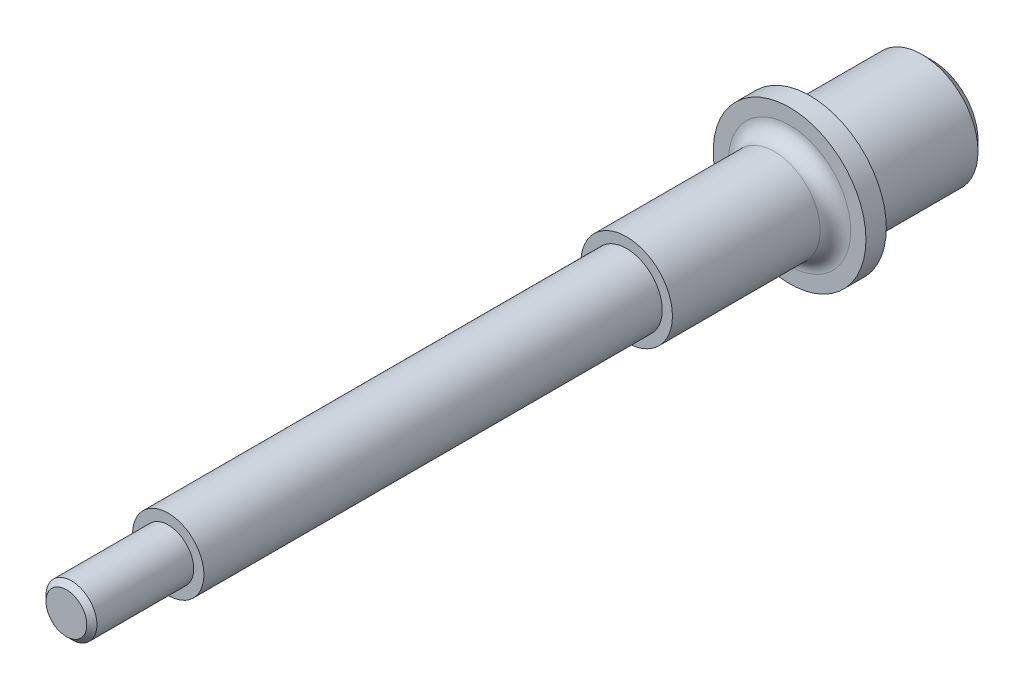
ISO-10303-21;
HEADER;
FILE_DESCRIPTION(('STEP AP214'),'2;1');
FILE_NAME('part.step','',(''),(''),'','','');
FILE_SCHEMA(('AUTOMOTIVE_DESIGN { 1 0 10303 214 1 1 1 1 }'));
ENDSEC;
DATA;
#1=APPLICATION_CONTEXT('core data for automotive mechanical design processes');
#2=APPLICATION_PROTOCOL_DEFINITION('international standard','automotive_design',2000,#1);
#3=PRODUCT_CONTEXT('',#1,'mechanical');
#4=PRODUCT('Part','Part','',(#3));
#5=PRODUCT_RELATED_PRODUCT_CATEGORY('part','',(#4));
#6=PRODUCT_DEFINITION_FORMATION('','',#4);
#7=PRODUCT_DEFINITION_CONTEXT('part definition',#1,'design');
#8=PRODUCT_DEFINITION('design','',#6,#7);
#9=PRODUCT_DEFINITION_SHAPE('','',#8);
#10=(LENGTH_UNIT() NAMED_UNIT(*) SI_UNIT(.MILLI.,.METRE.));
#11=(NAMED_UNIT(*) PLANE_ANGLE_UNIT() SI_UNIT($,.RADIAN.));
#12=(NAMED_UNIT(*) SI_UNIT($,.STERADIAN.) SOLID_ANGLE_UNIT());
#13=UNCERTAINTY_MEASURE_WITH_UNIT(LENGTH_MEASURE(1.E-05),#10,'distance_accuracy_value','');
#14=(GEOMETRIC_REPRESENTATION_CONTEXT(3) GLOBAL_UNCERTAINTY_ASSIGNED_CONTEXT((#13)) GLOBAL_UNIT_ASSIGNED_CONTEXT((#10,
#11,#12)) REPRESENTATION_CONTEXT('',''));
#15=CARTESIAN_POINT('',(0.,0.,0.));
#16=DIRECTION('',(0.,0.,1.));
#17=DIRECTION('',(1.,0.,0.));
#18=AXIS2_PLACEMENT_3D('',#15,#16,#17);
#19=CARTESIAN_POINT('',(0.,0.,24.));
#20=DIRECTION('',(0.,0.,-1.));
#21=DIRECTION('',(-1.,0.,0.));
#22=AXIS2_PLACEMENT_3D('',#19,#20,#21);
#23=CYLINDRICAL_SURFACE('',#22,11.);
#24=CARTESIAN_POINT('',(0.,0.,2.00000000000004));
#25=DIRECTION('',(0.,0.,1.));
#26=DIRECTION('',(1.,0.,0.));
#27=AXIS2_PLACEMENT_3D('',#24,#25,#26);
#28=CIRCLE('',#27,11.);
#29=CARTESIAN_POINT('',(11.,0.,2.00000000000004));
#30=VERTEX_POINT('',#29);
#31=EDGE_CURVE('E73',#30,#30,#28,.T.);
#32=ORIENTED_EDGE('',*,*,#31,.T.);
#33=EDGE_LOOP('',(#32));
#34=FACE_BOUND('',#33,.T.);
#35=CARTESIAN_POINT('',(0.,0.,24.));
#36=DIRECTION('',(0.,0.,1.));
#37=DIRECTION('',(1.,0.,0.));
#38=AXIS2_PLACEMENT_3D('',#35,#36,#37);
#39=CIRCLE('',#38,11.);
#40=CARTESIAN_POINT('',(11.,0.,24.));
#41=VERTEX_POINT('',#40);
#42=EDGE_CURVE('E78',#41,#41,#39,.T.);
#43=ORIENTED_EDGE('',*,*,#42,.F.);
#44=EDGE_LOOP('',(#43));
#45=FACE_BOUND('',#44,.T.);
#46=ADVANCED_FACE('F45',(#34,#45),#23,.T.);
#47=CARTESIAN_POINT('',(0.,0.,0.));
#48=DIRECTION('',(0.,0.,1.));
#49=DIRECTION('',(1.,0.,0.));
#50=AXIS2_PLACEMENT_3D('',#47,#48,#49);
#51=PLANE('',#50);
#52=CARTESIAN_POINT('',(0.,0.,0.));
#53=DIRECTION('',(0.,0.,1.));
#54=DIRECTION('',(1.,0.,0.));
#55=AXIS2_PLACEMENT_3D('',#52,#53,#54);
#56=CIRCLE('',#55,8.99999999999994);
#57=CARTESIAN_POINT('',(8.99999999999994,0.,0.));
#58=VERTEX_POINT('',#57);
#59=EDGE_CURVE('E69',#58,#58,#56,.F.);
#60=ORIENTED_EDGE('',*,*,#59,.T.);
#61=EDGE_LOOP('',(#60));
#62=FACE_BOUND('',#61,.T.);
#63=ADVANCED_FACE('F138',(#62),#51,.F.);
#64=CARTESIAN_POINT('',(0.,0.,28.));
#65=DIRECTION('',(0.,0.,-1.));
#66=DIRECTION('',(-1.,0.,0.));
#67=AXIS2_PLACEMENT_3D('',#64,#65,#66);
#68=CYLINDRICAL_SURFACE('',#67,15.);
#69=CARTESIAN_POINT('',(0.,0.,28.));
#70=DIRECTION('',(0.,0.,1.));
#71=DIRECTION('',(1.,0.,0.));
#72=AXIS2_PLACEMENT_3D('',#69,#70,#71);
#73=CIRCLE('',#72,15.);
#74=CARTESIAN_POINT('',(15.,0.,28.));
#75=VERTEX_POINT('',#74);
#76=EDGE_CURVE('E83',#75,#75,#73,.T.);
#77=ORIENTED_EDGE('',*,*,#76,.F.);
#78=EDGE_LOOP('',(#77));
#79=FACE_BOUND('',#78,.T.);
#80=CARTESIAN_POINT('',(0.,0.,24.));
#81=DIRECTION('',(0.,0.,1.));
#82=DIRECTION('',(1.,0.,0.));
#83=AXIS2_PLACEMENT_3D('',#80,#81,#82);
#84=CIRCLE('',#83,15.);
#85=CARTESIAN_POINT('',(15.,0.,24.));
#86=VERTEX_POINT('',#85);
#87=EDGE_CURVE('E84',#86,#86,#84,.T.);
#88=ORIENTED_EDGE('',*,*,#87,.T.);
#89=EDGE_LOOP('',(#88));
#90=FACE_BOUND('',#89,.T.);
#91=ADVANCED_FACE('F145',(#79,#90),#68,.T.);
#92=CARTESIAN_POINT('',(0.,0.,28.));
#93=DIRECTION('',(0.,0.,1.));
#94=DIRECTION('',(1.,0.,0.));
#95=AXIS2_PLACEMENT_3D('',#92,#93,#94);
#96=PLANE('',#95);
#97=CARTESIAN_POINT('',(0.,0.,28.));
#98=DIRECTION('',(0.,0.,1.));
#99=DIRECTION('',(1.,0.,0.));
#100=AXIS2_PLACEMENT_3D('',#97,#98,#99);
#101=CIRCLE('',#100,12.);
#102=CARTESIAN_POINT('',(12.,0.,28.));
#103=VERTEX_POINT('',#102);
#104=EDGE_CURVE('E10',#103,#103,#101,.F.);
#105=ORIENTED_EDGE('',*,*,#104,.T.);
#106=EDGE_LOOP('',(#105));
#107=FACE_BOUND('',#106,.T.);
#108=ORIENTED_EDGE('',*,*,#76,.T.);
#109=EDGE_LOOP('',(#108));
#110=FACE_BOUND('',#109,.T.);
#111=ADVANCED_FACE('F133',(#107,#110),#96,.T.);
#112=CARTESIAN_POINT('',(0.,0.,24.));
#113=DIRECTION('',(0.,0.,1.));
#114=DIRECTION('',(1.,0.,0.));
#115=AXIS2_PLACEMENT_3D('',#112,#113,#114);
#116=PLANE('',#115);
#117=ORIENTED_EDGE('',*,*,#42,.T.);
#118=EDGE_LOOP('',(#117));
#119=FACE_BOUND('',#118,.T.);
#120=ORIENTED_EDGE('',*,*,#87,.F.);
#121=EDGE_LOOP('',(#120));
#122=FACE_BOUND('',#121,.T.);
#123=ADVANCED_FACE('F128',(#119,#122),#116,.F.);
#124=CARTESIAN_POINT('',(0.,0.,60.));
#125=DIRECTION('',(0.,0.,-1.));
#126=DIRECTION('',(-1.,0.,0.));
#127=AXIS2_PLACEMENT_3D('',#124,#125,#126);
#128=CYLINDRICAL_SURFACE('',#127,9.);
#129=CARTESIAN_POINT('',(0.,0.,31.));
#130=DIRECTION('',(0.,0.,1.));
#131=DIRECTION('',(1.,0.,0.));
#132=AXIS2_PLACEMENT_3D('',#129,#130,#131);
#133=CIRCLE('',#132,9.);
#134=CARTESIAN_POINT('',(9.,0.,31.));
#135=VERTEX_POINT('',#134);
#136=EDGE_CURVE('E53',#135,#135,#133,.T.);
#137=ORIENTED_EDGE('',*,*,#136,.T.);
#138=EDGE_LOOP('',(#137));
#139=FACE_BOUND('',#138,.T.);
#140=CARTESIAN_POINT('',(0.,0.,60.));
#141=DIRECTION('',(0.,0.,1.));
#142=DIRECTION('',(1.,0.,0.));
#143=AXIS2_PLACEMENT_3D('',#140,#141,#142);
#144=CIRCLE('',#143,9.);
#145=CARTESIAN_POINT('',(9.,0.,60.));
#146=VERTEX_POINT('',#145);
#147=EDGE_CURVE('E88',#146,#146,#144,.T.);
#148=ORIENTED_EDGE('',*,*,#147,.F.);
#149=EDGE_LOOP('',(#148));
#150=FACE_BOUND('',#149,.T.);
#151=ADVANCED_FACE('F123',(#139,#150),#128,.T.);
#152=CARTESIAN_POINT('',(0.,0.,60.));
#153=DIRECTION('',(0.,0.,1.));
#154=DIRECTION('',(1.,0.,0.));
#155=AXIS2_PLACEMENT_3D('',#152,#153,#154);
#156=PLANE('',#155);
#157=CARTESIAN_POINT('',(0.,0.,60.));
#158=DIRECTION('',(0.,0.,1.));
#159=DIRECTION('',(1.,0.,0.));
#160=AXIS2_PLACEMENT_3D('',#157,#158,#159);
#161=CIRCLE('',#160,7.);
#162=CARTESIAN_POINT('',(-7.,0.,60.));
#163=VERTEX_POINT('',#162);
#164=EDGE_CURVE('E82',#163,#163,#161,.T.);
#165=ORIENTED_EDGE('',*,*,#164,.F.);
#166=EDGE_LOOP('',(#165));
#167=FACE_BOUND('',#166,.T.);
#168=ORIENTED_EDGE('',*,*,#147,.T.);
#169=EDGE_LOOP('',(#168));
#170=FACE_BOUND('',#169,.T.);
#171=ADVANCED_FACE('F117',(#167,#170),#156,.T.);
#172=CARTESIAN_POINT('',(0.,0.,150.));
#173=DIRECTION('',(0.,0.,-1.));
#174=DIRECTION('',(-1.,0.,0.));
#175=AXIS2_PLACEMENT_3D('',#172,#173,#174);
#176=CYLINDRICAL_SURFACE('',#175,7.);
#177=CARTESIAN_POINT('',(0.,0.,150.));
#178=DIRECTION('',(0.,0.,1.));
#179=DIRECTION('',(1.,0.,0.));
#180=AXIS2_PLACEMENT_3D('',#177,#178,#179);
#181=CIRCLE('',#180,7.);
#182=CARTESIAN_POINT('',(-7.,0.,150.));
#183=VERTEX_POINT('',#182);
#184=EDGE_CURVE('E95',#183,#183,#181,.T.);
#185=CARTESIAN_POINT('',(-7.,0.,150.));
#186=CARTESIAN_POINT('',(-7.,0.,149.0625));
#187=CARTESIAN_POINT('',(-7.,0.,148.125));
#188=CARTESIAN_POINT('',(-7.,0.,146.25));
#189=CARTESIAN_POINT('',(-7.,0.,145.3125));
#190=CARTESIAN_POINT('',(-7.,0.,143.4375));
#191=CARTESIAN_POINT('',(-7.,0.,142.5));
#192=CARTESIAN_POINT('',(-7.,0.,140.625));
#193=CARTESIAN_POINT('',(-7.,0.,139.6875));
#194=CARTESIAN_POINT('',(-7.,0.,137.8125));
#195=CARTESIAN_POINT('',(-7.,0.,136.875));
#196=CARTESIAN_POINT('',(-7.,0.,135.));
#197=CARTESIAN_POINT('',(-7.,0.,134.0625));
#198=CARTESIAN_POINT('',(-7.,0.,132.1875));
#199=CARTESIAN_POINT('',(-7.,0.,131.25));
#200=CARTESIAN_POINT('',(-7.,0.,129.375));
#201=CARTESIAN_POINT('',(-7.,0.,128.4375));
#202=CARTESIAN_POINT('',(-7.,0.,126.5625));
#203=CARTESIAN_POINT('',(-7.,0.,125.625));
#204=CARTESIAN_POINT('',(-7.,0.,123.75));
#205=CARTESIAN_POINT('',(-7.,0.,122.8125));
#206=CARTESIAN_POINT('',(-7.,0.,120.9375));
#207=CARTESIAN_POINT('',(-7.,0.,120.));
#208=CARTESIAN_POINT('',(-7.,0.,118.125));
#209=CARTESIAN_POINT('',(-7.,0.,117.1875));
#210=CARTESIAN_POINT('',(-7.,0.,115.3125));
#211=CARTESIAN_POINT('',(-7.,0.,114.375));
#212=CARTESIAN_POINT('',(-7.,0.,112.5));
#213=CARTESIAN_POINT('',(-7.,0.,111.5625));
#214=CARTESIAN_POINT('',(-7.,0.,109.6875));
#215=CARTESIAN_POINT('',(-7.,0.,108.75));
#216=CARTESIAN_POINT('',(-7.,0.,106.875));
#217=CARTESIAN_POINT('',(-7.,0.,105.9375));
#218=CARTESIAN_POINT('',(-7.,0.,104.0625));
#219=CARTESIAN_POINT('',(-7.,0.,103.125));
#220=CARTESIAN_POINT('',(-7.,0.,101.25));
#221=CARTESIAN_POINT('',(-7.,0.,100.3125));
#222=CARTESIAN_POINT('',(-7.,0.,98.4375));
#223=CARTESIAN_POINT('',(-7.,0.,97.5));
#224=CARTESIAN_POINT('',(-7.,0.,95.625));
#225=CARTESIAN_POINT('',(-7.,0.,94.6875));
#226=CARTESIAN_POINT('',(-7.,0.,92.8125));
#227=CARTESIAN_POINT('',(-7.,0.,91.875));
#228=CARTESIAN_POINT('',(-7.,0.,90.));
#229=CARTESIAN_POINT('',(-7.,0.,89.0625));
#230=CARTESIAN_POINT('',(-7.,0.,87.1875));
#231=CARTESIAN_POINT('',(-7.,0.,86.25));
#232=CARTESIAN_POINT('',(-7.,0.,84.375));
#233=CARTESIAN_POINT('',(-7.,0.,83.4375));
#234=CARTESIAN_POINT('',(-7.,0.,81.5625));
#235=CARTESIAN_POINT('',(-7.,0.,80.625));
#236=CARTESIAN_POINT('',(-7.,0.,78.75));
#237=CARTESIAN_POINT('',(-7.,0.,77.8125));
#238=CARTESIAN_POINT('',(-7.,0.,75.9375));
#239=CARTESIAN_POINT('',(-7.,0.,75.));
#240=CARTESIAN_POINT('',(-7.,0.,73.125));
#241=CARTESIAN_POINT('',(-7.,0.,72.1875));
#242=CARTESIAN_POINT('',(-7.,0.,70.3125));
#243=CARTESIAN_POINT('',(-7.,0.,69.375));
#244=CARTESIAN_POINT('',(-7.,0.,67.5));
#245=CARTESIAN_POINT('',(-7.,0.,66.5625));
#246=CARTESIAN_POINT('',(-7.,0.,64.6875));
#247=CARTESIAN_POINT('',(-7.,0.,63.75));
#248=CARTESIAN_POINT('',(-7.,0.,61.875));
#249=CARTESIAN_POINT('',(-7.,0.,60.9375));
#250=CARTESIAN_POINT('',(-7.,0.,60.));
#251=B_SPLINE_CURVE_WITH_KNOTS('',3,(#185,#186,#187,#188,#189,#190,#191,#192,#193,#194,#195,
#196,#197,#198,#199,#200,#201,#202,#203,#204,#205,#206,#207,#208,#209,#210,#211,#212,#213,#214,
#215,#216,#217,#218,#219,#220,#221,#222,#223,#224,#225,#226,#227,#228,#229,#230,#231,#232,#233,
#234,#235,#236,#237,#238,#239,#240,#241,#242,#243,#244,#245,#246,#247,#248,#249,#250),
.UNSPECIFIED.,.F.,.F.,(4,2,2,2,2,2,2,2,2,2,2,2,2,2,2,2,2,2,2,2,2,2,2,2,2,2,2,2,2,2,2,2,4),(0.,
2.8125,5.62499999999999,8.43749999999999,11.25,14.0625,16.875,19.6875,22.5,25.3125,28.125,
30.9375,33.75,36.5625,39.375,42.1875,45.,47.8125,50.625,53.4375,56.25,59.0625,61.875,64.6875,
67.5,70.3125,73.125,75.9375,78.75,81.5625,84.375,87.1875,90.),.UNSPECIFIED.);
#252=EDGE_CURVE('BSEAM111',#183,#163,#251,.T.);
#253=ORIENTED_EDGE('',*,*,#184,.F.);
#254=ORIENTED_EDGE('',*,*,#164,.T.);
#255=ORIENTED_EDGE('',*,*,#252,.T.);
#256=ORIENTED_EDGE('',*,*,#252,.F.);
#257=EDGE_LOOP('',(#253,#255,#254,#256));
#258=FACE_BOUND('',#257,.T.);
#259=ADVANCED_FACE('F111',(#258),#176,.T.);
#260=CARTESIAN_POINT('',(0.,0.,150.));
#261=DIRECTION('',(0.,0.,1.));
#262=DIRECTION('',(1.,0.,0.));
#263=AXIS2_PLACEMENT_3D('',#260,#261,#262);
#264=PLANE('',#263);
#265=CARTESIAN_POINT('',(0.,0.,150.));
#266=DIRECTION('',(0.,0.,1.));
#267=DIRECTION('',(1.,0.,0.));
#268=AXIS2_PLACEMENT_3D('',#265,#266,#267);
#269=CIRCLE('',#268,5.);
#270=CARTESIAN_POINT('',(5.,0.,150.));
#271=VERTEX_POINT('',#270);
#272=EDGE_CURVE('E77',#271,#271,#269,.T.);
#273=ORIENTED_EDGE('',*,*,#272,.F.);
#274=EDGE_LOOP('',(#273));
#275=FACE_BOUND('',#274,.T.);
#276=ORIENTED_EDGE('',*,*,#184,.T.);
#277=EDGE_LOOP('',(#276));
#278=FACE_BOUND('',#277,.T.);
#279=ADVANCED_FACE('F108',(#275,#278),#264,.T.);
#280=CARTESIAN_POINT('',(0.,0.,170.));
#281=DIRECTION('',(0.,0.,-1.));
#282=DIRECTION('',(-1.,0.,0.));
#283=AXIS2_PLACEMENT_3D('',#280,#281,#282);
#284=CYLINDRICAL_SURFACE('',#283,5.);
#285=CARTESIAN_POINT('',(0.,0.,169.));
#286=DIRECTION('',(0.,0.,1.));
#287=DIRECTION('',(1.,0.,0.));
#288=AXIS2_PLACEMENT_3D('',#285,#286,#287);
#289=CIRCLE('',#288,5.);
#290=CARTESIAN_POINT('',(5.,0.,169.));
#291=VERTEX_POINT('',#290);
#292=EDGE_CURVE('E58',#291,#291,#289,.F.);
#293=ORIENTED_EDGE('',*,*,#292,.T.);
#294=EDGE_LOOP('',(#293));
#295=FACE_BOUND('',#294,.T.);
#296=ORIENTED_EDGE('',*,*,#272,.T.);
#297=EDGE_LOOP('',(#296));
#298=FACE_BOUND('',#297,.T.);
#299=ADVANCED_FACE('F106',(#295,#298),#284,.T.);
#300=CARTESIAN_POINT('',(0.,0.,170.));
#301=DIRECTION('',(0.,0.,1.));
#302=DIRECTION('',(1.,0.,0.));
#303=AXIS2_PLACEMENT_3D('',#300,#301,#302);
#304=PLANE('',#303);
#305=CARTESIAN_POINT('',(0.,0.,170.));
#306=DIRECTION('',(0.,0.,1.));
#307=DIRECTION('',(1.,0.,0.));
#308=AXIS2_PLACEMENT_3D('',#305,#306,#307);
#309=CIRCLE('',#308,3.99999999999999);
#310=CARTESIAN_POINT('',(3.99999999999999,0.,170.));
#311=VERTEX_POINT('',#310);
#312=EDGE_CURVE('E63',#311,#311,#309,.T.);
#313=ORIENTED_EDGE('',*,*,#312,.T.);
#314=EDGE_LOOP('',(#313));
#315=FACE_BOUND('',#314,.T.);
#316=ADVANCED_FACE('F158',(#315),#304,.T.);
#317=CARTESIAN_POINT('',(0.,0.,2.00000000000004));
#318=DIRECTION('',(0.,0.,1.));
#319=DIRECTION('',(1.,0.,0.));
#320=AXIS2_PLACEMENT_3D('',#317,#318,#319);
#321=CONICAL_SURFACE('',#320,11.,0.785398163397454);
#322=ORIENTED_EDGE('',*,*,#59,.F.);
#323=EDGE_LOOP('',(#322));
#324=FACE_BOUND('',#323,.T.);
#325=ORIENTED_EDGE('',*,*,#31,.F.);
#326=EDGE_LOOP('',(#325));
#327=FACE_BOUND('',#326,.T.);
#328=ADVANCED_FACE('F152',(#324,#327),#321,.T.);
#329=CARTESIAN_POINT('',(0.,0.,170.));
#330=DIRECTION('',(0.,0.,-1.));
#331=DIRECTION('',(-1.,0.,0.));
#332=AXIS2_PLACEMENT_3D('',#329,#330,#331);
#333=CONICAL_SURFACE('',#332,3.99999999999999,0.785398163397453);
#334=ORIENTED_EDGE('',*,*,#292,.F.);
#335=EDGE_LOOP('',(#334));
#336=FACE_BOUND('',#335,.T.);
#337=ORIENTED_EDGE('',*,*,#312,.F.);
#338=EDGE_LOOP('',(#337));
#339=FACE_BOUND('',#338,.T.);
#340=ADVANCED_FACE('F157',(#336,#339),#333,.T.);
#341=CARTESIAN_POINT('',(0.,0.,31.));
#342=DIRECTION('',(0.,0.,1.));
#343=DIRECTION('',(1.,0.,0.));
#344=AXIS2_PLACEMENT_3D('',#341,#342,#343);
#345=TOROIDAL_SURFACE('',#344,12.,3.);
#346=ORIENTED_EDGE('',*,*,#104,.F.);
#347=EDGE_LOOP('',(#346));
#348=FACE_BOUND('',#347,.T.);
#349=ORIENTED_EDGE('',*,*,#136,.F.);
#350=EDGE_LOOP('',(#349));
#351=FACE_BOUND('',#350,.T.);
#352=ADVANCED_FACE('F47',(#348,#351),#345,.F.);
#353=CLOSED_SHELL('',(#46,#63,#91,#111,#123,#151,#171,#259,#279,#299,#316,#328,#340,#352));
#354=MANIFOLD_SOLID_BREP('B2',#353);
#355=ADVANCED_BREP_SHAPE_REPRESENTATION('',(#18,#354),#14);
#356=SHAPE_DEFINITION_REPRESENTATION(#9,#355);
ENDSEC;
END-ISO-10303-21;
